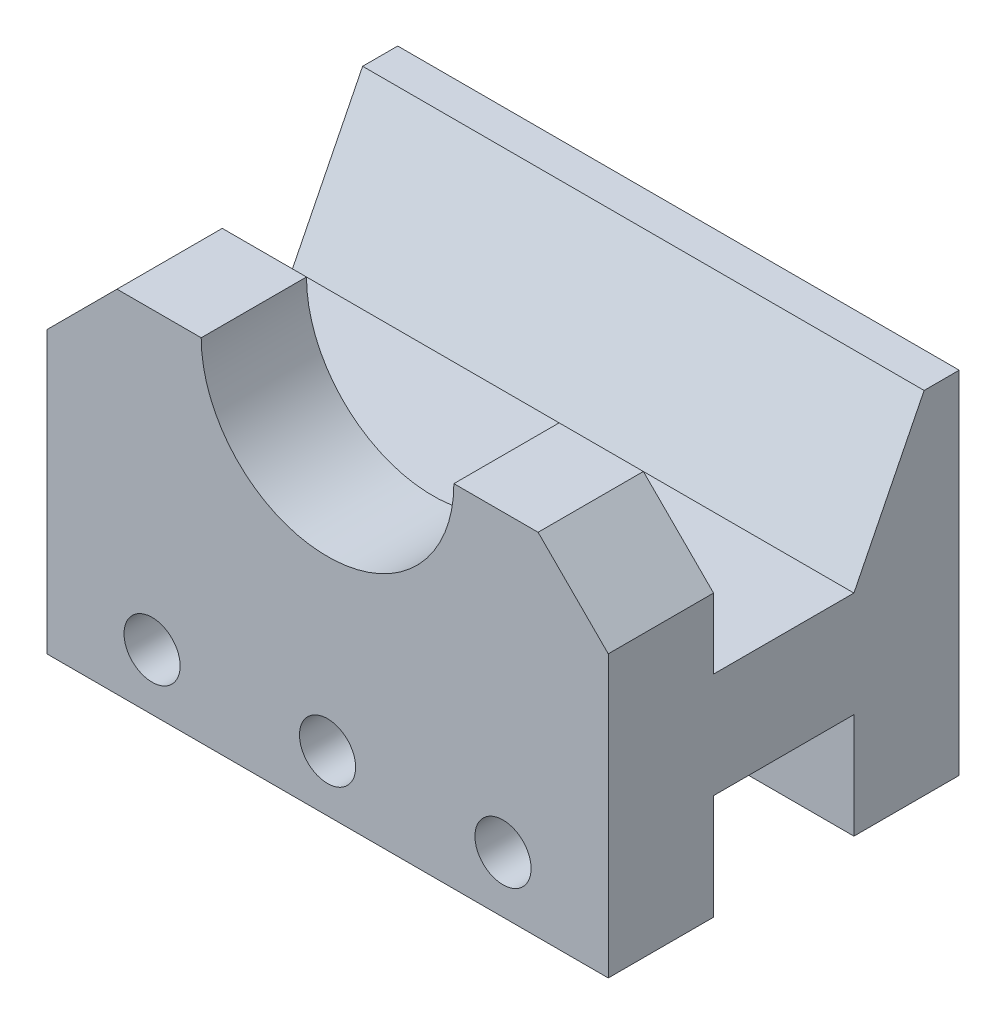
ISO-10303-21;
HEADER;
FILE_DESCRIPTION(('STEP AP214'),'2;1');
FILE_NAME('part.step','',(''),(''),'','','');
FILE_SCHEMA(('AUTOMOTIVE_DESIGN { 1 0 10303 214 1 1 1 1 }'));
ENDSEC;
DATA;
#1=APPLICATION_CONTEXT('core data for automotive mechanical design processes');
#2=APPLICATION_PROTOCOL_DEFINITION('international standard','automotive_design',2000,#1);
#3=PRODUCT_CONTEXT('',#1,'mechanical');
#4=PRODUCT('Part','Part','',(#3));
#5=PRODUCT_RELATED_PRODUCT_CATEGORY('part','',(#4));
#6=PRODUCT_DEFINITION_FORMATION('','',#4);
#7=PRODUCT_DEFINITION_CONTEXT('part definition',#1,'design');
#8=PRODUCT_DEFINITION('design','',#6,#7);
#9=PRODUCT_DEFINITION_SHAPE('','',#8);
#10=(LENGTH_UNIT() NAMED_UNIT(*) SI_UNIT(.MILLI.,.METRE.));
#11=(NAMED_UNIT(*) PLANE_ANGLE_UNIT() SI_UNIT($,.RADIAN.));
#12=(NAMED_UNIT(*) SI_UNIT($,.STERADIAN.) SOLID_ANGLE_UNIT());
#13=UNCERTAINTY_MEASURE_WITH_UNIT(LENGTH_MEASURE(1.E-05),#10,'distance_accuracy_value','');
#14=(GEOMETRIC_REPRESENTATION_CONTEXT(3) GLOBAL_UNCERTAINTY_ASSIGNED_CONTEXT((#13)) GLOBAL_UNIT_ASSIGNED_CONTEXT((#10,
#11,#12)) REPRESENTATION_CONTEXT('',''));
#15=CARTESIAN_POINT('',(0.,0.,0.));
#16=DIRECTION('',(0.,0.,1.));
#17=DIRECTION('',(1.,0.,0.));
#18=AXIS2_PLACEMENT_3D('',#15,#16,#17);
#19=CARTESIAN_POINT('',(0.,50.,-50.));
#20=DIRECTION('',(0.,-1.,0.));
#21=DIRECTION('',(0.,0.,-1.));
#22=AXIS2_PLACEMENT_3D('',#19,#20,#21);
#23=PLANE('',#22);
#24=DIRECTION('',(1.,0.,0.));
#25=VECTOR('',#24,1.);
#26=CARTESIAN_POINT('',(0.,50.,0.));
#27=LINE('',#26,#25);
#28=CARTESIAN_POINT('',(58.,50.,0.));
#29=VERTEX_POINT('',#28);
#30=CARTESIAN_POINT('',(69.9999999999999,50.,0.));
#31=VERTEX_POINT('',#30);
#32=EDGE_CURVE('E158',#29,#31,#27,.T.);
#33=ORIENTED_EDGE('',*,*,#32,.T.);
#34=DIRECTION('',(0.,0.,-1.));
#35=VECTOR('',#34,1.);
#36=CARTESIAN_POINT('',(70.,50.,-49.9999999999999));
#37=LINE('',#36,#35);
#38=CARTESIAN_POINT('',(70.,50.,-15.));
#39=VERTEX_POINT('',#38);
#40=EDGE_CURVE('E201',#31,#39,#37,.T.);
#41=ORIENTED_EDGE('',*,*,#40,.T.);
#42=DIRECTION('',(-1.,0.,0.));
#43=VECTOR('',#42,1.);
#44=CARTESIAN_POINT('',(80.,50.,-15.));
#45=LINE('',#44,#43);
#46=CARTESIAN_POINT('',(58.,50.,-15.));
#47=VERTEX_POINT('',#46);
#48=EDGE_CURVE('E161',#39,#47,#45,.T.);
#49=ORIENTED_EDGE('',*,*,#48,.T.);
#50=DIRECTION('',(0.,0.,1.));
#51=VECTOR('',#50,1.);
#52=CARTESIAN_POINT('',(58.,50.,-50.001));
#53=LINE('',#52,#51);
#54=EDGE_CURVE('E148',#29,#47,#53,.F.);
#55=ORIENTED_EDGE('',*,*,#54,.F.);
#56=EDGE_LOOP('',(#33,#41,#49,#55));
#57=FACE_BOUND('',#56,.T.);
#58=ADVANCED_FACE('F30',(#57),#23,.F.);
#59=CARTESIAN_POINT('',(22.,50.,-15.));
#60=VERTEX_POINT('',#59);
#61=CARTESIAN_POINT('',(10.,50.,-15.));
#62=VERTEX_POINT('',#61);
#63=EDGE_CURVE('E265',#60,#62,#45,.T.);
#64=ORIENTED_EDGE('',*,*,#63,.T.);
#65=DIRECTION('',(0.,0.,1.));
#66=VECTOR('',#65,1.);
#67=CARTESIAN_POINT('',(10.,50.,-50.));
#68=LINE('',#67,#66);
#69=CARTESIAN_POINT('',(10.,50.,0.));
#70=VERTEX_POINT('',#69);
#71=EDGE_CURVE('E39',#62,#70,#68,.T.);
#72=ORIENTED_EDGE('',*,*,#71,.T.);
#73=CARTESIAN_POINT('',(22.,50.,0.));
#74=VERTEX_POINT('',#73);
#75=EDGE_CURVE('E167',#70,#74,#27,.T.);
#76=ORIENTED_EDGE('',*,*,#75,.T.);
#77=DIRECTION('',(0.,0.,1.));
#78=VECTOR('',#77,1.);
#79=CARTESIAN_POINT('',(22.,50.,-50.001));
#80=LINE('',#79,#78);
#81=EDGE_CURVE('E151',#60,#74,#80,.T.);
#82=ORIENTED_EDGE('',*,*,#81,.F.);
#83=EDGE_LOOP('',(#64,#72,#76,#82));
#84=FACE_BOUND('',#83,.T.);
#85=ADVANCED_FACE('F335',(#84),#23,.F.);
#86=CARTESIAN_POINT('',(0.,0.,-50.));
#87=DIRECTION('',(0.,-1.,0.));
#88=DIRECTION('',(0.,0.,-1.));
#89=AXIS2_PLACEMENT_3D('',#86,#87,#88);
#90=PLANE('',#89);
#91=DIRECTION('',(-1.,0.,0.));
#92=VECTOR('',#91,1.);
#93=CARTESIAN_POINT('',(80.,0.,-35.));
#94=LINE('',#93,#92);
#95=CARTESIAN_POINT('',(80.,0.,-35.));
#96=VERTEX_POINT('',#95);
#97=CARTESIAN_POINT('',(0.,0.,-35.));
#98=VERTEX_POINT('',#97);
#99=EDGE_CURVE('E281',#96,#98,#94,.T.);
#100=ORIENTED_EDGE('',*,*,#99,.T.);
#101=DIRECTION('',(0.,0.,1.));
#102=VECTOR('',#101,1.);
#103=CARTESIAN_POINT('',(0.,0.,0.));
#104=LINE('',#103,#102);
#105=CARTESIAN_POINT('',(0.,0.,-50.));
#106=VERTEX_POINT('',#105);
#107=EDGE_CURVE('E180',#106,#98,#104,.T.);
#108=ORIENTED_EDGE('',*,*,#107,.F.);
#109=DIRECTION('',(-1.,0.,0.));
#110=VECTOR('',#109,1.);
#111=CARTESIAN_POINT('',(0.,0.,-50.));
#112=LINE('',#111,#110);
#113=CARTESIAN_POINT('',(80.,0.,-50.));
#114=VERTEX_POINT('',#113);
#115=EDGE_CURVE('E172',#114,#106,#112,.T.);
#116=ORIENTED_EDGE('',*,*,#115,.F.);
#117=DIRECTION('',(0.,0.,-1.));
#118=VECTOR('',#117,1.);
#119=CARTESIAN_POINT('',(80.,0.,0.));
#120=LINE('',#119,#118);
#121=EDGE_CURVE('E187',#96,#114,#120,.T.);
#122=ORIENTED_EDGE('',*,*,#121,.F.);
#123=EDGE_LOOP('',(#100,#108,#116,#122));
#124=FACE_BOUND('',#123,.T.);
#125=ADVANCED_FACE('F297',(#124),#90,.T.);
#126=CARTESIAN_POINT('',(0.,50.,0.));
#127=DIRECTION('',(1.,0.,0.));
#128=DIRECTION('',(0.,0.,-1.));
#129=AXIS2_PLACEMENT_3D('',#126,#127,#128);
#130=PLANE('',#129);
#131=DIRECTION('',(0.,-1.,0.));
#132=VECTOR('',#131,1.);
#133=CARTESIAN_POINT('',(0.,50.,0.));
#134=LINE('',#133,#132);
#135=CARTESIAN_POINT('',(0.,40.,0.));
#136=VERTEX_POINT('',#135);
#137=CARTESIAN_POINT('',(0.,0.,0.));
#138=VERTEX_POINT('',#137);
#139=EDGE_CURVE('E199',#136,#138,#134,.T.);
#140=ORIENTED_EDGE('',*,*,#139,.F.);
#141=DIRECTION('',(0.,0.,-1.));
#142=VECTOR('',#141,1.);
#143=CARTESIAN_POINT('',(0.,40.,0.));
#144=LINE('',#143,#142);
#145=CARTESIAN_POINT('',(0.,40.,-15.));
#146=VERTEX_POINT('',#145);
#147=EDGE_CURVE('E11',#136,#146,#144,.T.);
#148=ORIENTED_EDGE('',*,*,#147,.T.);
#149=DIRECTION('',(0.,1.,0.));
#150=VECTOR('',#149,1.);
#151=CARTESIAN_POINT('',(0.,50.,-15.));
#152=LINE('',#151,#150);
#153=CARTESIAN_POINT('',(0.,30.,-15.));
#154=VERTEX_POINT('',#153);
#155=EDGE_CURVE('E249',#154,#146,#152,.T.);
#156=ORIENTED_EDGE('',*,*,#155,.F.);
#157=DIRECTION('',(0.,0.,1.));
#158=VECTOR('',#157,1.);
#159=CARTESIAN_POINT('',(0.,30.,-15.));
#160=LINE('',#159,#158);
#161=CARTESIAN_POINT('',(0.,30.,-35.));
#162=VERTEX_POINT('',#161);
#163=EDGE_CURVE('E258',#162,#154,#160,.T.);
#164=ORIENTED_EDGE('',*,*,#163,.F.);
#165=DIRECTION('',(0.,-0.894427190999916,0.447213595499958));
#166=VECTOR('',#165,1.);
#167=CARTESIAN_POINT('',(0.,30.,-35.));
#168=LINE('',#167,#166);
#169=CARTESIAN_POINT('',(0.,50.,-45.));
#170=VERTEX_POINT('',#169);
#171=EDGE_CURVE('E244',#170,#162,#168,.T.);
#172=ORIENTED_EDGE('',*,*,#171,.F.);
#173=DIRECTION('',(0.,0.,1.));
#174=VECTOR('',#173,1.);
#175=CARTESIAN_POINT('',(0.,50.,0.));
#176=LINE('',#175,#174);
#177=CARTESIAN_POINT('',(0.,50.,-50.));
#178=VERTEX_POINT('',#177);
#179=EDGE_CURVE('E168',#178,#170,#176,.T.);
#180=ORIENTED_EDGE('',*,*,#179,.F.);
#181=DIRECTION('',(0.,-1.,0.));
#182=VECTOR('',#181,1.);
#183=CARTESIAN_POINT('',(0.,50.,-50.));
#184=LINE('',#183,#182);
#185=EDGE_CURVE('E179',#178,#106,#184,.T.);
#186=ORIENTED_EDGE('',*,*,#185,.T.);
#187=ORIENTED_EDGE('',*,*,#107,.T.);
#188=DIRECTION('',(0.,-1.,0.));
#189=VECTOR('',#188,1.);
#190=CARTESIAN_POINT('',(0.,0.,-35.));
#191=LINE('',#190,#189);
#192=CARTESIAN_POINT('',(0.,15.,-35.));
#193=VERTEX_POINT('',#192);
#194=EDGE_CURVE('E264',#193,#98,#191,.T.);
#195=ORIENTED_EDGE('',*,*,#194,.F.);
#196=DIRECTION('',(0.,0.,-1.));
#197=VECTOR('',#196,1.);
#198=CARTESIAN_POINT('',(0.,15.,-35.));
#199=LINE('',#198,#197);
#200=CARTESIAN_POINT('',(0.,15.,-15.));
#201=VERTEX_POINT('',#200);
#202=EDGE_CURVE('E275',#201,#193,#199,.T.);
#203=ORIENTED_EDGE('',*,*,#202,.F.);
#204=DIRECTION('',(0.,1.,0.));
#205=VECTOR('',#204,1.);
#206=CARTESIAN_POINT('',(0.,0.,-15.));
#207=LINE('',#206,#205);
#208=CARTESIAN_POINT('',(0.,0.,-15.));
#209=VERTEX_POINT('',#208);
#210=EDGE_CURVE('E283',#209,#201,#207,.T.);
#211=ORIENTED_EDGE('',*,*,#210,.F.);
#212=EDGE_CURVE('E184',#209,#138,#104,.T.);
#213=ORIENTED_EDGE('',*,*,#212,.T.);
#214=EDGE_LOOP('',(#140,#148,#156,#164,#172,#180,#186,#187,#195,#203,#211,#213));
#215=FACE_BOUND('',#214,.T.);
#216=ADVANCED_FACE('F303',(#215),#130,.F.);
#217=CARTESIAN_POINT('',(0.,50.,0.));
#218=DIRECTION('',(0.,0.,-1.));
#219=DIRECTION('',(-1.,0.,0.));
#220=AXIS2_PLACEMENT_3D('',#217,#218,#219);
#221=PLANE('',#220);
#222=CARTESIAN_POINT('',(65.,8.00000000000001,0.));
#223=DIRECTION('',(0.,0.,1.));
#224=DIRECTION('',(1.,0.,0.));
#225=AXIS2_PLACEMENT_3D('',#222,#223,#224);
#226=CIRCLE('',#225,4.00000000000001);
#227=CARTESIAN_POINT('',(69.,8.00000000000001,0.));
#228=VERTEX_POINT('',#227);
#229=EDGE_CURVE('E558',#228,#228,#226,.T.);
#230=ORIENTED_EDGE('',*,*,#229,.F.);
#231=EDGE_LOOP('',(#230));
#232=FACE_BOUND('',#231,.T.);
#233=CARTESIAN_POINT('',(40.,8.,0.));
#234=DIRECTION('',(0.,0.,1.));
#235=DIRECTION('',(1.,0.,0.));
#236=AXIS2_PLACEMENT_3D('',#233,#234,#235);
#237=CIRCLE('',#236,4.);
#238=CARTESIAN_POINT('',(44.,8.,0.));
#239=VERTEX_POINT('',#238);
#240=EDGE_CURVE('E226',#239,#239,#237,.T.);
#241=ORIENTED_EDGE('',*,*,#240,.F.);
#242=EDGE_LOOP('',(#241));
#243=FACE_BOUND('',#242,.T.);
#244=CARTESIAN_POINT('',(15.,8.,0.));
#245=DIRECTION('',(0.,0.,1.));
#246=DIRECTION('',(1.,0.,0.));
#247=AXIS2_PLACEMENT_3D('',#244,#245,#246);
#248=CIRCLE('',#247,4.);
#249=CARTESIAN_POINT('',(19.,8.,0.));
#250=VERTEX_POINT('',#249);
#251=EDGE_CURVE('E223',#250,#250,#248,.T.);
#252=ORIENTED_EDGE('',*,*,#251,.F.);
#253=EDGE_LOOP('',(#252));
#254=FACE_BOUND('',#253,.T.);
#255=DIRECTION('',(0.,-1.,0.));
#256=VECTOR('',#255,1.);
#257=CARTESIAN_POINT('',(80.,50.,0.));
#258=LINE('',#257,#256);
#259=CARTESIAN_POINT('',(80.,40.,0.));
#260=VERTEX_POINT('',#259);
#261=CARTESIAN_POINT('',(80.,0.,0.));
#262=VERTEX_POINT('',#261);
#263=EDGE_CURVE('E197',#260,#262,#258,.T.);
#264=ORIENTED_EDGE('',*,*,#263,.F.);
#265=DIRECTION('',(0.707106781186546,-0.70710678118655,0.));
#266=VECTOR('',#265,1.);
#267=CARTESIAN_POINT('',(70.,50.,0.));
#268=LINE('',#267,#266);
#269=EDGE_CURVE('E166',#260,#31,#268,.F.);
#270=ORIENTED_EDGE('',*,*,#269,.T.);
#271=ORIENTED_EDGE('',*,*,#32,.F.);
#272=CARTESIAN_POINT('',(40.,50.,0.));
#273=DIRECTION('',(0.,0.,1.));
#274=DIRECTION('',(1.,0.,0.));
#275=AXIS2_PLACEMENT_3D('',#272,#273,#274);
#276=CIRCLE('',#275,18.);
#277=EDGE_CURVE('E145',#74,#29,#276,.T.);
#278=ORIENTED_EDGE('',*,*,#277,.F.);
#279=ORIENTED_EDGE('',*,*,#75,.F.);
#280=DIRECTION('',(0.707106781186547,0.707106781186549,0.));
#281=VECTOR('',#280,1.);
#282=CARTESIAN_POINT('',(10.,50.,0.));
#283=LINE('',#282,#281);
#284=EDGE_CURVE('E47',#70,#136,#283,.F.);
#285=ORIENTED_EDGE('',*,*,#284,.T.);
#286=ORIENTED_EDGE('',*,*,#139,.T.);
#287=DIRECTION('',(1.,0.,0.));
#288=VECTOR('',#287,1.);
#289=CARTESIAN_POINT('',(0.,0.,0.));
#290=LINE('',#289,#288);
#291=EDGE_CURVE('E183',#138,#262,#290,.T.);
#292=ORIENTED_EDGE('',*,*,#291,.T.);
#293=EDGE_LOOP('',(#264,#270,#271,#278,#279,#285,#286,#292));
#294=FACE_BOUND('',#293,.T.);
#295=ADVANCED_FACE('F164',(#232,#243,#254,#294),#221,.F.);
#296=CARTESIAN_POINT('',(80.,50.,0.));
#297=DIRECTION('',(-1.,0.,0.));
#298=DIRECTION('',(0.,0.,1.));
#299=AXIS2_PLACEMENT_3D('',#296,#297,#298);
#300=PLANE('',#299);
#301=DIRECTION('',(0.,1.,0.));
#302=VECTOR('',#301,1.);
#303=CARTESIAN_POINT('',(80.,50.,-15.));
#304=LINE('',#303,#302);
#305=CARTESIAN_POINT('',(80.,30.,-15.));
#306=VERTEX_POINT('',#305);
#307=CARTESIAN_POINT('',(80.,40.,-15.));
#308=VERTEX_POINT('',#307);
#309=EDGE_CURVE('E252',#306,#308,#304,.T.);
#310=ORIENTED_EDGE('',*,*,#309,.T.);
#311=DIRECTION('',(0.,0.,1.));
#312=VECTOR('',#311,1.);
#313=CARTESIAN_POINT('',(80.,40.,0.));
#314=LINE('',#313,#312);
#315=EDGE_CURVE('E207',#308,#260,#314,.T.);
#316=ORIENTED_EDGE('',*,*,#315,.T.);
#317=ORIENTED_EDGE('',*,*,#263,.T.);
#318=CARTESIAN_POINT('',(80.,0.,-15.));
#319=VERTEX_POINT('',#318);
#320=EDGE_CURVE('E188',#262,#319,#120,.T.);
#321=ORIENTED_EDGE('',*,*,#320,.T.);
#322=DIRECTION('',(0.,1.,0.));
#323=VECTOR('',#322,1.);
#324=CARTESIAN_POINT('',(80.,0.,-15.));
#325=LINE('',#324,#323);
#326=CARTESIAN_POINT('',(80.,15.,-15.));
#327=VERTEX_POINT('',#326);
#328=EDGE_CURVE('E274',#319,#327,#325,.T.);
#329=ORIENTED_EDGE('',*,*,#328,.T.);
#330=DIRECTION('',(0.,0.,-1.));
#331=VECTOR('',#330,1.);
#332=CARTESIAN_POINT('',(80.,15.,-35.));
#333=LINE('',#332,#331);
#334=CARTESIAN_POINT('',(80.,15.,-35.));
#335=VERTEX_POINT('',#334);
#336=EDGE_CURVE('E278',#327,#335,#333,.T.);
#337=ORIENTED_EDGE('',*,*,#336,.T.);
#338=DIRECTION('',(0.,-1.,0.));
#339=VECTOR('',#338,1.);
#340=CARTESIAN_POINT('',(80.,0.,-35.));
#341=LINE('',#340,#339);
#342=EDGE_CURVE('E271',#335,#96,#341,.T.);
#343=ORIENTED_EDGE('',*,*,#342,.T.);
#344=ORIENTED_EDGE('',*,*,#121,.T.);
#345=DIRECTION('',(0.,-1.,0.));
#346=VECTOR('',#345,1.);
#347=CARTESIAN_POINT('',(80.,50.,-50.));
#348=LINE('',#347,#346);
#349=CARTESIAN_POINT('',(80.,50.,-50.));
#350=VERTEX_POINT('',#349);
#351=EDGE_CURVE('E194',#350,#114,#348,.T.);
#352=ORIENTED_EDGE('',*,*,#351,.F.);
#353=DIRECTION('',(0.,0.,-1.));
#354=VECTOR('',#353,1.);
#355=CARTESIAN_POINT('',(80.,50.,0.));
#356=LINE('',#355,#354);
#357=CARTESIAN_POINT('',(80.,50.,-45.));
#358=VERTEX_POINT('',#357);
#359=EDGE_CURVE('E170',#358,#350,#356,.T.);
#360=ORIENTED_EDGE('',*,*,#359,.F.);
#361=DIRECTION('',(0.,-0.894427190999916,0.447213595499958));
#362=VECTOR('',#361,1.);
#363=CARTESIAN_POINT('',(80.,30.,-35.));
#364=LINE('',#363,#362);
#365=CARTESIAN_POINT('',(80.,30.,-35.));
#366=VERTEX_POINT('',#365);
#367=EDGE_CURVE('E245',#358,#366,#364,.T.);
#368=ORIENTED_EDGE('',*,*,#367,.T.);
#369=DIRECTION('',(0.,0.,1.));
#370=VECTOR('',#369,1.);
#371=CARTESIAN_POINT('',(80.,30.,-15.));
#372=LINE('',#371,#370);
#373=EDGE_CURVE('E248',#366,#306,#372,.T.);
#374=ORIENTED_EDGE('',*,*,#373,.T.);
#375=EDGE_LOOP('',(#310,#316,#317,#321,#329,#337,#343,#344,#352,#360,#368,#374));
#376=FACE_BOUND('',#375,.T.);
#377=ADVANCED_FACE('F314',(#376),#300,.F.);
#378=CARTESIAN_POINT('',(0.,50.,-50.));
#379=DIRECTION('',(0.,0.,1.));
#380=DIRECTION('',(1.,0.,0.));
#381=AXIS2_PLACEMENT_3D('',#378,#379,#380);
#382=PLANE('',#381);
#383=CARTESIAN_POINT('',(65.,8.00000000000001,-50.));
#384=DIRECTION('',(0.,0.,1.));
#385=DIRECTION('',(1.,0.,0.));
#386=AXIS2_PLACEMENT_3D('',#383,#384,#385);
#387=CIRCLE('',#386,4.00000000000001);
#388=CARTESIAN_POINT('',(69.,8.00000000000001,-50.));
#389=VERTEX_POINT('',#388);
#390=EDGE_CURVE('E553',#389,#389,#387,.T.);
#391=ORIENTED_EDGE('',*,*,#390,.T.);
#392=EDGE_LOOP('',(#391));
#393=FACE_BOUND('',#392,.T.);
#394=CARTESIAN_POINT('',(40.,8.,-50.));
#395=DIRECTION('',(0.,0.,1.));
#396=DIRECTION('',(1.,0.,0.));
#397=AXIS2_PLACEMENT_3D('',#394,#395,#396);
#398=CIRCLE('',#397,4.);
#399=CARTESIAN_POINT('',(44.,8.,-50.));
#400=VERTEX_POINT('',#399);
#401=EDGE_CURVE('E219',#400,#400,#398,.T.);
#402=ORIENTED_EDGE('',*,*,#401,.T.);
#403=EDGE_LOOP('',(#402));
#404=FACE_BOUND('',#403,.T.);
#405=CARTESIAN_POINT('',(15.,8.,-50.));
#406=DIRECTION('',(0.,0.,1.));
#407=DIRECTION('',(1.,0.,0.));
#408=AXIS2_PLACEMENT_3D('',#405,#406,#407);
#409=CIRCLE('',#408,4.);
#410=CARTESIAN_POINT('',(19.,8.,-50.));
#411=VERTEX_POINT('',#410);
#412=EDGE_CURVE('E215',#411,#411,#409,.T.);
#413=ORIENTED_EDGE('',*,*,#412,.T.);
#414=EDGE_LOOP('',(#413));
#415=FACE_BOUND('',#414,.T.);
#416=ORIENTED_EDGE('',*,*,#115,.T.);
#417=ORIENTED_EDGE('',*,*,#185,.F.);
#418=DIRECTION('',(-1.,0.,0.));
#419=VECTOR('',#418,1.);
#420=CARTESIAN_POINT('',(0.,50.,-50.));
#421=LINE('',#420,#419);
#422=EDGE_CURVE('E177',#350,#178,#421,.T.);
#423=ORIENTED_EDGE('',*,*,#422,.F.);
#424=ORIENTED_EDGE('',*,*,#351,.T.);
#425=EDGE_LOOP('',(#416,#417,#423,#424));
#426=FACE_BOUND('',#425,.T.);
#427=ADVANCED_FACE('F310',(#393,#404,#415,#426),#382,.F.);
#428=ORIENTED_EDGE('',*,*,#179,.T.);
#429=DIRECTION('',(-1.,0.,0.));
#430=VECTOR('',#429,1.);
#431=CARTESIAN_POINT('',(80.,50.,-45.));
#432=LINE('',#431,#430);
#433=EDGE_CURVE('E255',#358,#170,#432,.T.);
#434=ORIENTED_EDGE('',*,*,#433,.F.);
#435=ORIENTED_EDGE('',*,*,#359,.T.);
#436=ORIENTED_EDGE('',*,*,#422,.T.);
#437=EDGE_LOOP('',(#428,#434,#435,#436));
#438=FACE_BOUND('',#437,.T.);
#439=ADVANCED_FACE('F338',(#438),#23,.F.);
#440=DIRECTION('',(-1.,0.,0.));
#441=VECTOR('',#440,1.);
#442=CARTESIAN_POINT('',(80.,0.,-15.));
#443=LINE('',#442,#441);
#444=EDGE_CURVE('E292',#319,#209,#443,.T.);
#445=ORIENTED_EDGE('',*,*,#444,.F.);
#446=ORIENTED_EDGE('',*,*,#320,.F.);
#447=ORIENTED_EDGE('',*,*,#291,.F.);
#448=ORIENTED_EDGE('',*,*,#212,.F.);
#449=EDGE_LOOP('',(#445,#446,#447,#448));
#450=FACE_BOUND('',#449,.T.);
#451=ADVANCED_FACE('F326',(#450),#90,.T.);
#452=CARTESIAN_POINT('',(80.,0.,-35.));
#453=DIRECTION('',(0.,0.,-1.));
#454=DIRECTION('',(-1.,0.,0.));
#455=AXIS2_PLACEMENT_3D('',#452,#453,#454);
#456=PLANE('',#455);
#457=CARTESIAN_POINT('',(65.,8.00000000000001,-35.));
#458=DIRECTION('',(0.,0.,-1.));
#459=DIRECTION('',(-1.,0.,0.));
#460=AXIS2_PLACEMENT_3D('',#457,#458,#459);
#461=CIRCLE('',#460,4.00000000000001);
#462=CARTESIAN_POINT('',(61.,8.00000000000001,-35.));
#463=VERTEX_POINT('',#462);
#464=EDGE_CURVE('E231',#463,#463,#461,.T.);
#465=ORIENTED_EDGE('',*,*,#464,.T.);
#466=EDGE_LOOP('',(#465));
#467=FACE_BOUND('',#466,.T.);
#468=CARTESIAN_POINT('',(40.,8.,-35.));
#469=DIRECTION('',(0.,0.,-1.));
#470=DIRECTION('',(-1.,0.,0.));
#471=AXIS2_PLACEMENT_3D('',#468,#469,#470);
#472=CIRCLE('',#471,4.);
#473=CARTESIAN_POINT('',(36.,8.,-35.));
#474=VERTEX_POINT('',#473);
#475=EDGE_CURVE('E218',#474,#474,#472,.T.);
#476=ORIENTED_EDGE('',*,*,#475,.T.);
#477=EDGE_LOOP('',(#476));
#478=FACE_BOUND('',#477,.T.);
#479=CARTESIAN_POINT('',(15.,8.,-35.));
#480=DIRECTION('',(0.,0.,-1.));
#481=DIRECTION('',(-1.,0.,0.));
#482=AXIS2_PLACEMENT_3D('',#479,#480,#481);
#483=CIRCLE('',#482,4.);
#484=CARTESIAN_POINT('',(11.,8.,-35.));
#485=VERTEX_POINT('',#484);
#486=EDGE_CURVE('E214',#485,#485,#483,.T.);
#487=ORIENTED_EDGE('',*,*,#486,.T.);
#488=EDGE_LOOP('',(#487));
#489=FACE_BOUND('',#488,.T.);
#490=ORIENTED_EDGE('',*,*,#194,.T.);
#491=ORIENTED_EDGE('',*,*,#99,.F.);
#492=ORIENTED_EDGE('',*,*,#342,.F.);
#493=DIRECTION('',(-1.,0.,0.));
#494=VECTOR('',#493,1.);
#495=CARTESIAN_POINT('',(80.,15.,-35.));
#496=LINE('',#495,#494);
#497=EDGE_CURVE('E288',#335,#193,#496,.T.);
#498=ORIENTED_EDGE('',*,*,#497,.T.);
#499=EDGE_LOOP('',(#490,#491,#492,#498));
#500=FACE_BOUND('',#499,.T.);
#501=ADVANCED_FACE('F316',(#467,#478,#489,#500),#456,.F.);
#502=CARTESIAN_POINT('',(80.,15.,-35.));
#503=DIRECTION('',(0.,1.,0.));
#504=DIRECTION('',(0.,0.,1.));
#505=AXIS2_PLACEMENT_3D('',#502,#503,#504);
#506=PLANE('',#505);
#507=ORIENTED_EDGE('',*,*,#202,.T.);
#508=ORIENTED_EDGE('',*,*,#497,.F.);
#509=ORIENTED_EDGE('',*,*,#336,.F.);
#510=DIRECTION('',(-1.,0.,0.));
#511=VECTOR('',#510,1.);
#512=CARTESIAN_POINT('',(80.,15.,-15.));
#513=LINE('',#512,#511);
#514=EDGE_CURVE('E290',#327,#201,#513,.T.);
#515=ORIENTED_EDGE('',*,*,#514,.T.);
#516=EDGE_LOOP('',(#507,#508,#509,#515));
#517=FACE_BOUND('',#516,.T.);
#518=ADVANCED_FACE('F318',(#517),#506,.F.);
#519=CARTESIAN_POINT('',(80.,0.,-15.));
#520=DIRECTION('',(0.,0.,1.));
#521=DIRECTION('',(1.,0.,0.));
#522=AXIS2_PLACEMENT_3D('',#519,#520,#521);
#523=PLANE('',#522);
#524=CARTESIAN_POINT('',(65.,8.00000000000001,-15.));
#525=DIRECTION('',(0.,0.,1.));
#526=DIRECTION('',(1.,0.,0.));
#527=AXIS2_PLACEMENT_3D('',#524,#525,#526);
#528=CIRCLE('',#527,4.00000000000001);
#529=CARTESIAN_POINT('',(69.,8.00000000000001,-15.));
#530=VERTEX_POINT('',#529);
#531=EDGE_CURVE('E34',#530,#530,#528,.T.);
#532=ORIENTED_EDGE('',*,*,#531,.T.);
#533=EDGE_LOOP('',(#532));
#534=FACE_BOUND('',#533,.T.);
#535=CARTESIAN_POINT('',(40.,8.,-15.));
#536=DIRECTION('',(0.,0.,1.));
#537=DIRECTION('',(1.,0.,0.));
#538=AXIS2_PLACEMENT_3D('',#535,#536,#537);
#539=CIRCLE('',#538,4.);
#540=CARTESIAN_POINT('',(44.,8.,-15.));
#541=VERTEX_POINT('',#540);
#542=EDGE_CURVE('E216',#541,#541,#539,.T.);
#543=ORIENTED_EDGE('',*,*,#542,.T.);
#544=EDGE_LOOP('',(#543));
#545=FACE_BOUND('',#544,.T.);
#546=CARTESIAN_POINT('',(15.,8.,-15.));
#547=DIRECTION('',(0.,0.,1.));
#548=DIRECTION('',(1.,0.,0.));
#549=AXIS2_PLACEMENT_3D('',#546,#547,#548);
#550=CIRCLE('',#549,4.);
#551=CARTESIAN_POINT('',(19.,8.,-15.));
#552=VERTEX_POINT('',#551);
#553=EDGE_CURVE('E212',#552,#552,#550,.T.);
#554=ORIENTED_EDGE('',*,*,#553,.T.);
#555=EDGE_LOOP('',(#554));
#556=FACE_BOUND('',#555,.T.);
#557=ORIENTED_EDGE('',*,*,#210,.T.);
#558=ORIENTED_EDGE('',*,*,#514,.F.);
#559=ORIENTED_EDGE('',*,*,#328,.F.);
#560=ORIENTED_EDGE('',*,*,#444,.T.);
#561=EDGE_LOOP('',(#557,#558,#559,#560));
#562=FACE_BOUND('',#561,.T.);
#563=ADVANCED_FACE('F408',(#534,#545,#556,#562),#523,.F.);
#564=CARTESIAN_POINT('',(80.,50.,-15.));
#565=DIRECTION('',(0.,0.,1.));
#566=DIRECTION('',(0.,-1.,0.));
#567=AXIS2_PLACEMENT_3D('',#564,#565,#566);
#568=PLANE('',#567);
#569=ORIENTED_EDGE('',*,*,#48,.F.);
#570=DIRECTION('',(-0.707106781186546,0.70710678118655,0.));
#571=VECTOR('',#570,1.);
#572=CARTESIAN_POINT('',(70.,50.,-15.));
#573=LINE('',#572,#571);
#574=EDGE_CURVE('E205',#39,#308,#573,.F.);
#575=ORIENTED_EDGE('',*,*,#574,.T.);
#576=ORIENTED_EDGE('',*,*,#309,.F.);
#577=DIRECTION('',(-1.,0.,0.));
#578=VECTOR('',#577,1.);
#579=CARTESIAN_POINT('',(80.,30.,-15.));
#580=LINE('',#579,#578);
#581=EDGE_CURVE('E266',#306,#154,#580,.T.);
#582=ORIENTED_EDGE('',*,*,#581,.T.);
#583=ORIENTED_EDGE('',*,*,#155,.T.);
#584=DIRECTION('',(-0.707106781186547,-0.707106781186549,0.));
#585=VECTOR('',#584,1.);
#586=CARTESIAN_POINT('',(10.,50.,-15.));
#587=LINE('',#586,#585);
#588=EDGE_CURVE('E203',#146,#62,#587,.F.);
#589=ORIENTED_EDGE('',*,*,#588,.T.);
#590=ORIENTED_EDGE('',*,*,#63,.F.);
#591=CARTESIAN_POINT('',(40.,50.,-15.));
#592=DIRECTION('',(0.,0.,1.));
#593=DIRECTION('',(0.,-1.,0.));
#594=AXIS2_PLACEMENT_3D('',#591,#592,#593);
#595=CIRCLE('',#594,18.);
#596=EDGE_CURVE('E153',#47,#60,#595,.F.);
#597=ORIENTED_EDGE('',*,*,#596,.F.);
#598=EDGE_LOOP('',(#569,#575,#576,#582,#583,#589,#590,#597));
#599=FACE_BOUND('',#598,.T.);
#600=ADVANCED_FACE('F333',(#599),#568,.F.);
#601=CARTESIAN_POINT('',(80.,30.,-15.));
#602=DIRECTION('',(0.,-1.,0.));
#603=DIRECTION('',(0.,0.,-1.));
#604=AXIS2_PLACEMENT_3D('',#601,#602,#603);
#605=PLANE('',#604);
#606=ORIENTED_EDGE('',*,*,#163,.T.);
#607=ORIENTED_EDGE('',*,*,#581,.F.);
#608=ORIENTED_EDGE('',*,*,#373,.F.);
#609=DIRECTION('',(-1.,0.,0.));
#610=VECTOR('',#609,1.);
#611=CARTESIAN_POINT('',(80.,30.,-35.));
#612=LINE('',#611,#610);
#613=EDGE_CURVE('E268',#366,#162,#612,.T.);
#614=ORIENTED_EDGE('',*,*,#613,.T.);
#615=EDGE_LOOP('',(#606,#607,#608,#614));
#616=FACE_BOUND('',#615,.T.);
#617=ADVANCED_FACE('F358',(#616),#605,.F.);
#618=CARTESIAN_POINT('',(80.,30.,-35.));
#619=DIRECTION('',(0.,-0.447213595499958,-0.894427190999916));
#620=DIRECTION('',(0.,0.894427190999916,-0.447213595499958));
#621=AXIS2_PLACEMENT_3D('',#618,#619,#620);
#622=PLANE('',#621);
#623=ORIENTED_EDGE('',*,*,#171,.T.);
#624=ORIENTED_EDGE('',*,*,#613,.F.);
#625=ORIENTED_EDGE('',*,*,#367,.F.);
#626=ORIENTED_EDGE('',*,*,#433,.T.);
#627=EDGE_LOOP('',(#623,#624,#625,#626));
#628=FACE_BOUND('',#627,.T.);
#629=ADVANCED_FACE('F355',(#628),#622,.F.);
#630=CARTESIAN_POINT('',(40.,50.,-50.001));
#631=DIRECTION('',(0.,0.,1.));
#632=DIRECTION('',(1.,0.,0.));
#633=AXIS2_PLACEMENT_3D('',#630,#631,#632);
#634=CYLINDRICAL_SURFACE('',#633,18.);
#635=ORIENTED_EDGE('',*,*,#54,.T.);
#636=ORIENTED_EDGE('',*,*,#596,.T.);
#637=ORIENTED_EDGE('',*,*,#81,.T.);
#638=ORIENTED_EDGE('',*,*,#277,.T.);
#639=EDGE_LOOP('',(#635,#636,#637,#638));
#640=FACE_BOUND('',#639,.T.);
#641=ADVANCED_FACE('F147',(#640),#634,.F.);
#642=CARTESIAN_POINT('',(70.,50.,-49.9999999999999));
#643=DIRECTION('',(-0.70710678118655,-0.707106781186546,0.));
#644=DIRECTION('',(0.707106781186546,-0.70710678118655,0.));
#645=AXIS2_PLACEMENT_3D('',#642,#643,#644);
#646=PLANE('',#645);
#647=ORIENTED_EDGE('',*,*,#269,.F.);
#648=ORIENTED_EDGE('',*,*,#315,.F.);
#649=ORIENTED_EDGE('',*,*,#574,.F.);
#650=ORIENTED_EDGE('',*,*,#40,.F.);
#651=EDGE_LOOP('',(#647,#648,#649,#650));
#652=FACE_BOUND('',#651,.T.);
#653=ADVANCED_FACE('F363',(#652),#646,.F.);
#654=CARTESIAN_POINT('',(10.,50.,-50.));
#655=DIRECTION('',(0.707106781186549,-0.707106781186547,0.));
#656=DIRECTION('',(0.707106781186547,0.707106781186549,0.));
#657=AXIS2_PLACEMENT_3D('',#654,#655,#656);
#658=PLANE('',#657);
#659=ORIENTED_EDGE('',*,*,#588,.F.);
#660=ORIENTED_EDGE('',*,*,#147,.F.);
#661=ORIENTED_EDGE('',*,*,#284,.F.);
#662=ORIENTED_EDGE('',*,*,#71,.F.);
#663=EDGE_LOOP('',(#659,#660,#661,#662));
#664=FACE_BOUND('',#663,.T.);
#665=ADVANCED_FACE('F32',(#664),#658,.F.);
#666=CARTESIAN_POINT('',(15.,8.,-50.));
#667=DIRECTION('',(0.,0.,1.));
#668=DIRECTION('',(1.,0.,0.));
#669=AXIS2_PLACEMENT_3D('',#666,#667,#668);
#670=CYLINDRICAL_SURFACE('',#669,4.);
#671=ORIENTED_EDGE('',*,*,#251,.T.);
#672=EDGE_LOOP('',(#671));
#673=FACE_BOUND('',#672,.T.);
#674=ORIENTED_EDGE('',*,*,#553,.F.);
#675=EDGE_LOOP('',(#674));
#676=FACE_BOUND('',#675,.T.);
#677=ADVANCED_FACE('F369',(#673,#676),#670,.F.);
#678=ORIENTED_EDGE('',*,*,#412,.F.);
#679=EDGE_LOOP('',(#678));
#680=FACE_BOUND('',#679,.T.);
#681=ORIENTED_EDGE('',*,*,#486,.F.);
#682=EDGE_LOOP('',(#681));
#683=FACE_BOUND('',#682,.T.);
#684=ADVANCED_FACE('F424',(#680,#683),#670,.F.);
#685=CARTESIAN_POINT('',(40.,8.,-50.));
#686=DIRECTION('',(0.,0.,1.));
#687=DIRECTION('',(1.,0.,0.));
#688=AXIS2_PLACEMENT_3D('',#685,#686,#687);
#689=CYLINDRICAL_SURFACE('',#688,4.);
#690=ORIENTED_EDGE('',*,*,#240,.T.);
#691=EDGE_LOOP('',(#690));
#692=FACE_BOUND('',#691,.T.);
#693=ORIENTED_EDGE('',*,*,#542,.F.);
#694=EDGE_LOOP('',(#693));
#695=FACE_BOUND('',#694,.T.);
#696=ADVANCED_FACE('F435',(#692,#695),#689,.F.);
#697=ORIENTED_EDGE('',*,*,#401,.F.);
#698=EDGE_LOOP('',(#697));
#699=FACE_BOUND('',#698,.T.);
#700=ORIENTED_EDGE('',*,*,#475,.F.);
#701=EDGE_LOOP('',(#700));
#702=FACE_BOUND('',#701,.T.);
#703=ADVANCED_FACE('F444',(#699,#702),#689,.F.);
#704=CARTESIAN_POINT('',(65.,8.00000000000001,-50.));
#705=DIRECTION('',(0.,0.,1.));
#706=DIRECTION('',(1.,0.,0.));
#707=AXIS2_PLACEMENT_3D('',#704,#705,#706);
#708=CYLINDRICAL_SURFACE('',#707,4.00000000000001);
#709=ORIENTED_EDGE('',*,*,#229,.T.);
#710=EDGE_LOOP('',(#709));
#711=FACE_BOUND('',#710,.T.);
#712=ORIENTED_EDGE('',*,*,#531,.F.);
#713=EDGE_LOOP('',(#712));
#714=FACE_BOUND('',#713,.T.);
#715=ADVANCED_FACE('F454',(#711,#714),#708,.F.);
#716=ORIENTED_EDGE('',*,*,#390,.F.);
#717=EDGE_LOOP('',(#716));
#718=FACE_BOUND('',#717,.T.);
#719=ORIENTED_EDGE('',*,*,#464,.F.);
#720=EDGE_LOOP('',(#719));
#721=FACE_BOUND('',#720,.T.);
#722=ADVANCED_FACE('F463',(#718,#721),#708,.F.);
#723=CLOSED_SHELL('',(#58,#85,#125,#216,#295,#377,#427,#439,#451,#501,#518,#563,#600,#617,#629,
#641,#653,#665,#677,#684,#696,#703,#715,#722));
#724=MANIFOLD_SOLID_BREP('B2',#723);
#725=ADVANCED_BREP_SHAPE_REPRESENTATION('',(#18,#724),#14);
#726=SHAPE_DEFINITION_REPRESENTATION(#9,#725);
ENDSEC;
END-ISO-10303-21;
